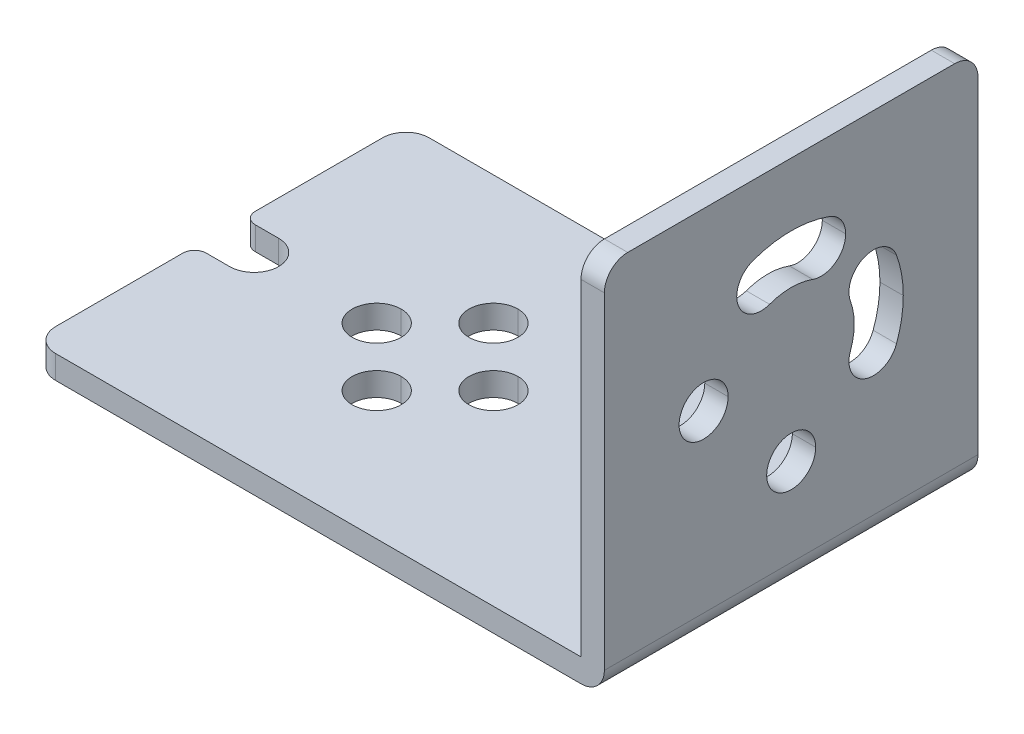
ISO-10303-21;
HEADER;
FILE_DESCRIPTION(('STEP AP214'),'2;1');
FILE_NAME('part.step','',(''),(''),'','','');
FILE_SCHEMA(('AUTOMOTIVE_DESIGN { 1 0 10303 214 1 1 1 1 }'));
ENDSEC;
DATA;
#1=APPLICATION_CONTEXT('core data for automotive mechanical design processes');
#2=APPLICATION_PROTOCOL_DEFINITION('international standard','automotive_design',2000,#1);
#3=PRODUCT_CONTEXT('',#1,'mechanical');
#4=PRODUCT('Part','Part','',(#3));
#5=PRODUCT_RELATED_PRODUCT_CATEGORY('part','',(#4));
#6=PRODUCT_DEFINITION_FORMATION('','',#4);
#7=PRODUCT_DEFINITION_CONTEXT('part definition',#1,'design');
#8=PRODUCT_DEFINITION('design','',#6,#7);
#9=PRODUCT_DEFINITION_SHAPE('','',#8);
#10=(LENGTH_UNIT() NAMED_UNIT(*) SI_UNIT(.MILLI.,.METRE.));
#11=(NAMED_UNIT(*) PLANE_ANGLE_UNIT() SI_UNIT($,.RADIAN.));
#12=(NAMED_UNIT(*) SI_UNIT($,.STERADIAN.) SOLID_ANGLE_UNIT());
#13=UNCERTAINTY_MEASURE_WITH_UNIT(LENGTH_MEASURE(1.E-05),#10,'distance_accuracy_value','');
#14=(GEOMETRIC_REPRESENTATION_CONTEXT(3) GLOBAL_UNCERTAINTY_ASSIGNED_CONTEXT((#13)) GLOBAL_UNIT_ASSIGNED_CONTEXT((#10,
#11,#12)) REPRESENTATION_CONTEXT('',''));
#15=CARTESIAN_POINT('',(0.,0.,0.));
#16=DIRECTION('',(0.,0.,1.));
#17=DIRECTION('',(1.,0.,0.));
#18=AXIS2_PLACEMENT_3D('',#15,#16,#17);
#19=CARTESIAN_POINT('',(-2.,2.,-16.));
#20=DIRECTION('',(0.,0.,-1.));
#21=DIRECTION('',(-1.,0.,0.));
#22=AXIS2_PLACEMENT_3D('',#19,#20,#21);
#23=CYLINDRICAL_SURFACE('',#22,2.);
#24=CARTESIAN_POINT('',(-2.,2.,16.));
#25=DIRECTION('',(0.,0.,1.));
#26=DIRECTION('',(-1.,0.,0.));
#27=AXIS2_PLACEMENT_3D('',#24,#25,#26);
#28=CIRCLE('',#27,2.);
#29=CARTESIAN_POINT('',(-2.,0.,16.));
#30=VERTEX_POINT('',#29);
#31=CARTESIAN_POINT('',(0.,2.,16.));
#32=VERTEX_POINT('',#31);
#33=EDGE_CURVE('E394',#30,#32,#28,.T.);
#34=ORIENTED_EDGE('',*,*,#33,.F.);
#35=DIRECTION('',(0.,0.,1.));
#36=VECTOR('',#35,1.);
#37=CARTESIAN_POINT('',(-2.,0.,14.));
#38=LINE('',#37,#36);
#39=CARTESIAN_POINT('',(-2.,0.,-16.));
#40=VERTEX_POINT('',#39);
#41=EDGE_CURVE('E683',#40,#30,#38,.T.);
#42=ORIENTED_EDGE('',*,*,#41,.F.);
#43=CARTESIAN_POINT('',(-2.,2.,-16.));
#44=DIRECTION('',(0.,0.,-1.));
#45=DIRECTION('',(1.,0.,0.));
#46=AXIS2_PLACEMENT_3D('',#43,#44,#45);
#47=CIRCLE('',#46,2.);
#48=CARTESIAN_POINT('',(0.,2.,-16.));
#49=VERTEX_POINT('',#48);
#50=EDGE_CURVE('E560',#49,#40,#47,.T.);
#51=ORIENTED_EDGE('',*,*,#50,.F.);
#52=DIRECTION('',(0.,0.,-1.));
#53=VECTOR('',#52,1.);
#54=CARTESIAN_POINT('',(0.,2.,-16.));
#55=LINE('',#54,#53);
#56=EDGE_CURVE('E316',#32,#49,#55,.T.);
#57=ORIENTED_EDGE('',*,*,#56,.F.);
#58=EDGE_LOOP('',(#34,#42,#51,#57));
#59=FACE_BOUND('',#58,.T.);
#60=ADVANCED_FACE('F16',(#59),#23,.T.);
#61=CARTESIAN_POINT('',(-2.,24.0476946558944,-2.56515107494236));
#62=DIRECTION('',(1.,0.,0.));
#63=DIRECTION('',(0.,0.,-1.));
#64=AXIS2_PLACEMENT_3D('',#61,#62,#63);
#65=CYLINDRICAL_SURFACE('',#64,2.1);
#66=DIRECTION('',(1.,0.,0.));
#67=VECTOR('',#66,1.);
#68=CARTESIAN_POINT('',(-2.,24.0476946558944,-4.66515107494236));
#69=LINE('',#68,#67);
#70=CARTESIAN_POINT('',(-2.,24.0476946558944,-4.66515107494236));
#71=VERTEX_POINT('',#70);
#72=CARTESIAN_POINT('',(0.,24.0476946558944,-4.66515107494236));
#73=VERTEX_POINT('',#72);
#74=EDGE_CURVE('E287',#71,#73,#69,.T.);
#75=ORIENTED_EDGE('',*,*,#74,.F.);
#76=CARTESIAN_POINT('',(-2.,24.0476946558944,-2.56515107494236));
#77=DIRECTION('',(1.,0.,0.));
#78=DIRECTION('',(0.,0.,-1.));
#79=AXIS2_PLACEMENT_3D('',#76,#77,#78);
#80=CIRCLE('',#79,2.1);
#81=CARTESIAN_POINT('',(-2.,22.0743401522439,-1.84690877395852));
#82=VERTEX_POINT('',#81);
#83=EDGE_CURVE('E283',#82,#71,#80,.T.);
#84=ORIENTED_EDGE('',*,*,#83,.F.);
#85=DIRECTION('',(1.,0.,0.));
#86=VECTOR('',#85,1.);
#87=CARTESIAN_POINT('',(-2.,22.0743401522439,-1.84690877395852));
#88=LINE('',#87,#86);
#89=CARTESIAN_POINT('',(0.,22.0743401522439,-1.84690877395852));
#90=VERTEX_POINT('',#89);
#91=EDGE_CURVE('E268',#82,#90,#88,.T.);
#92=ORIENTED_EDGE('',*,*,#91,.T.);
#93=CARTESIAN_POINT('',(0.,24.0476946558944,-2.56515107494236));
#94=DIRECTION('',(1.,0.,0.));
#95=DIRECTION('',(0.,0.,-1.));
#96=AXIS2_PLACEMENT_3D('',#93,#94,#95);
#97=CIRCLE('',#96,2.1);
#98=EDGE_CURVE('E338',#90,#73,#97,.T.);
#99=ORIENTED_EDGE('',*,*,#98,.T.);
#100=EDGE_LOOP('',(#75,#84,#92,#99));
#101=FACE_BOUND('',#100,.T.);
#102=ADVANCED_FACE('F284',(#101),#65,.F.);
#103=CARTESIAN_POINT('',(-2.,17.,0.));
#104=DIRECTION('',(1.,0.,0.));
#105=DIRECTION('',(0.,0.,-1.));
#106=AXIS2_PLACEMENT_3D('',#103,#104,#105);
#107=CYLINDRICAL_SURFACE('',#106,9.6);
#108=CARTESIAN_POINT('',(0.,17.,0.));
#109=DIRECTION('',(1.,0.,0.));
#110=DIRECTION('',(0.,0.,-1.));
#111=AXIS2_PLACEMENT_3D('',#108,#109,#110);
#112=CIRCLE('',#111,9.6);
#113=CARTESIAN_POINT('',(0.,26.0210491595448,-3.28339337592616));
#114=VERTEX_POINT('',#113);
#115=CARTESIAN_POINT('',(0.,26.0210491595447,3.28339337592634));
#116=VERTEX_POINT('',#115);
#117=EDGE_CURVE('E334',#114,#116,#112,.T.);
#118=ORIENTED_EDGE('',*,*,#117,.T.);
#119=DIRECTION('',(1.,0.,0.));
#120=VECTOR('',#119,1.);
#121=CARTESIAN_POINT('',(-2.,26.0210491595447,3.28339337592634));
#122=LINE('',#121,#120);
#123=CARTESIAN_POINT('',(-2.,26.0210491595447,3.28339337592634));
#124=VERTEX_POINT('',#123);
#125=EDGE_CURVE('E10',#124,#116,#122,.T.);
#126=ORIENTED_EDGE('',*,*,#125,.F.);
#127=CARTESIAN_POINT('',(-2.,17.,0.));
#128=DIRECTION('',(1.,0.,0.));
#129=DIRECTION('',(0.,0.,-1.));
#130=AXIS2_PLACEMENT_3D('',#127,#128,#129);
#131=CIRCLE('',#130,9.6);
#132=CARTESIAN_POINT('',(-2.,26.0210491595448,-3.28339337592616));
#133=VERTEX_POINT('',#132);
#134=EDGE_CURVE('E292',#133,#124,#131,.T.);
#135=ORIENTED_EDGE('',*,*,#134,.F.);
#136=DIRECTION('',(1.,0.,0.));
#137=VECTOR('',#136,1.);
#138=CARTESIAN_POINT('',(-2.,26.0210491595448,-3.28339337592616));
#139=LINE('',#138,#137);
#140=EDGE_CURVE('E453',#133,#114,#139,.T.);
#141=ORIENTED_EDGE('',*,*,#140,.T.);
#142=EDGE_LOOP('',(#118,#126,#135,#141));
#143=FACE_BOUND('',#142,.T.);
#144=ADVANCED_FACE('F847',(#143),#107,.F.);
#145=CARTESIAN_POINT('',(-2.,24.0476946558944,2.56515107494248));
#146=DIRECTION('',(1.,0.,0.));
#147=DIRECTION('',(0.,0.,-1.));
#148=AXIS2_PLACEMENT_3D('',#145,#146,#147);
#149=CYLINDRICAL_SURFACE('',#148,2.1);
#150=CARTESIAN_POINT('',(0.,24.0476946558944,2.56515107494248));
#151=DIRECTION('',(1.,0.,0.));
#152=DIRECTION('',(0.,0.,-1.));
#153=AXIS2_PLACEMENT_3D('',#150,#151,#152);
#154=CIRCLE('',#153,2.1);
#155=CARTESIAN_POINT('',(0.,22.0743401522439,1.84690877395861));
#156=VERTEX_POINT('',#155);
#157=EDGE_CURVE('E330',#116,#156,#154,.T.);
#158=ORIENTED_EDGE('',*,*,#157,.T.);
#159=DIRECTION('',(1.,0.,0.));
#160=VECTOR('',#159,1.);
#161=CARTESIAN_POINT('',(-2.,22.0743401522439,1.84690877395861));
#162=LINE('',#161,#160);
#163=CARTESIAN_POINT('',(-2.,22.0743401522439,1.84690877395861));
#164=VERTEX_POINT('',#163);
#165=EDGE_CURVE('E26',#164,#156,#162,.T.);
#166=ORIENTED_EDGE('',*,*,#165,.F.);
#167=CARTESIAN_POINT('',(-2.,24.0476946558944,2.56515107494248));
#168=DIRECTION('',(1.,0.,0.));
#169=DIRECTION('',(0.,0.,-1.));
#170=AXIS2_PLACEMENT_3D('',#167,#168,#169);
#171=CIRCLE('',#170,2.1);
#172=EDGE_CURVE('E298',#124,#164,#171,.T.);
#173=ORIENTED_EDGE('',*,*,#172,.F.);
#174=ORIENTED_EDGE('',*,*,#125,.T.);
#175=EDGE_LOOP('',(#158,#166,#173,#174));
#176=FACE_BOUND('',#175,.T.);
#177=ADVANCED_FACE('F934',(#176),#149,.F.);
#178=CARTESIAN_POINT('',(-2.,17.,0.));
#179=DIRECTION('',(1.,0.,0.));
#180=DIRECTION('',(0.,0.,-1.));
#181=AXIS2_PLACEMENT_3D('',#178,#179,#180);
#182=CYLINDRICAL_SURFACE('',#181,5.4);
#183=CARTESIAN_POINT('',(0.,17.,0.));
#184=DIRECTION('',(-1.,0.,0.));
#185=DIRECTION('',(0.,0.,-1.));
#186=AXIS2_PLACEMENT_3D('',#183,#184,#185);
#187=CIRCLE('',#186,5.4);
#188=EDGE_CURVE('E275',#156,#90,#187,.T.);
#189=ORIENTED_EDGE('',*,*,#188,.T.);
#190=ORIENTED_EDGE('',*,*,#91,.F.);
#191=CARTESIAN_POINT('',(-2.,17.,0.));
#192=DIRECTION('',(-1.,0.,0.));
#193=DIRECTION('',(0.,0.,-1.));
#194=AXIS2_PLACEMENT_3D('',#191,#192,#193);
#195=CIRCLE('',#194,5.4);
#196=EDGE_CURVE('E272',#164,#82,#195,.T.);
#197=ORIENTED_EDGE('',*,*,#196,.F.);
#198=ORIENTED_EDGE('',*,*,#165,.T.);
#199=EDGE_LOOP('',(#189,#190,#197,#198));
#200=FACE_BOUND('',#199,.T.);
#201=ADVANCED_FACE('F270',(#200),#182,.T.);
#202=CARTESIAN_POINT('',(-2.,9.5,-1.17961196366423E-13));
#203=DIRECTION('',(1.,0.,0.));
#204=DIRECTION('',(0.,0.,-1.));
#205=AXIS2_PLACEMENT_3D('',#202,#203,#204);
#206=CYLINDRICAL_SURFACE('',#205,2.1);
#207=DIRECTION('',(1.,0.,0.));
#208=VECTOR('',#207,1.);
#209=CARTESIAN_POINT('',(-2.,9.5,2.09999999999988));
#210=LINE('',#209,#208);
#211=CARTESIAN_POINT('',(-2.,9.5,2.09999999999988));
#212=VERTEX_POINT('',#211);
#213=CARTESIAN_POINT('',(0.,9.5,2.09999999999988));
#214=VERTEX_POINT('',#213);
#215=EDGE_CURVE('E469',#212,#214,#210,.T.);
#216=ORIENTED_EDGE('',*,*,#215,.F.);
#217=CARTESIAN_POINT('',(-2.,9.5,-1.17961196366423E-13));
#218=DIRECTION('',(1.,0.,0.));
#219=DIRECTION('',(0.,0.,-1.));
#220=AXIS2_PLACEMENT_3D('',#217,#218,#219);
#221=CIRCLE('',#220,2.1);
#222=CARTESIAN_POINT('',(-2.,9.5,-2.10000000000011));
#223=VERTEX_POINT('',#222);
#224=EDGE_CURVE('E390',#223,#212,#221,.T.);
#225=ORIENTED_EDGE('',*,*,#224,.F.);
#226=DIRECTION('',(1.,0.,0.));
#227=VECTOR('',#226,1.);
#228=CARTESIAN_POINT('',(-2.,9.5,-2.10000000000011));
#229=LINE('',#228,#227);
#230=CARTESIAN_POINT('',(0.,9.5,-2.10000000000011));
#231=VERTEX_POINT('',#230);
#232=EDGE_CURVE('E468',#223,#231,#229,.T.);
#233=ORIENTED_EDGE('',*,*,#232,.T.);
#234=CARTESIAN_POINT('',(0.,9.5,-1.17961196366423E-13));
#235=DIRECTION('',(1.,0.,0.));
#236=DIRECTION('',(0.,0.,-1.));
#237=AXIS2_PLACEMENT_3D('',#234,#235,#236);
#238=CIRCLE('',#237,2.1);
#239=EDGE_CURVE('E347',#231,#214,#238,.T.);
#240=ORIENTED_EDGE('',*,*,#239,.T.);
#241=EDGE_LOOP('',(#216,#225,#233,#240));
#242=FACE_BOUND('',#241,.T.);
#243=ADVANCED_FACE('F921',(#242),#206,.F.);
#244=CARTESIAN_POINT('',(-2.,14.4348489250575,-7.04769465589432));
#245=DIRECTION('',(1.,0.,0.));
#246=DIRECTION('',(0.,0.,-1.));
#247=AXIS2_PLACEMENT_3D('',#244,#245,#246);
#248=CYLINDRICAL_SURFACE('',#247,2.1);
#249=CARTESIAN_POINT('',(0.,14.4348489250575,-7.04769465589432));
#250=DIRECTION('',(1.,0.,0.));
#251=DIRECTION('',(0.,0.,-1.));
#252=AXIS2_PLACEMENT_3D('',#249,#250,#251);
#253=CIRCLE('',#252,2.1);
#254=CARTESIAN_POINT('',(0.,15.1530912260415,-5.07434015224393));
#255=VERTEX_POINT('',#254);
#256=CARTESIAN_POINT('',(0.,13.7166066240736,-9.02104915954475));
#257=VERTEX_POINT('',#256);
#258=EDGE_CURVE('E371',#255,#257,#253,.T.);
#259=ORIENTED_EDGE('',*,*,#258,.T.);
#260=DIRECTION('',(1.,0.,0.));
#261=VECTOR('',#260,1.);
#262=CARTESIAN_POINT('',(-2.,13.7166066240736,-9.02104915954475));
#263=LINE('',#262,#261);
#264=CARTESIAN_POINT('',(-2.,13.7166066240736,-9.02104915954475));
#265=VERTEX_POINT('',#264);
#266=EDGE_CURVE('E19',#265,#257,#263,.T.);
#267=ORIENTED_EDGE('',*,*,#266,.F.);
#268=CARTESIAN_POINT('',(-2.,14.4348489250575,-7.04769465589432));
#269=DIRECTION('',(1.,0.,0.));
#270=DIRECTION('',(0.,0.,-1.));
#271=AXIS2_PLACEMENT_3D('',#268,#269,#270);
#272=CIRCLE('',#271,2.1);
#273=CARTESIAN_POINT('',(-2.,15.1530912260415,-5.07434015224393));
#274=VERTEX_POINT('',#273);
#275=EDGE_CURVE('E343',#274,#265,#272,.T.);
#276=ORIENTED_EDGE('',*,*,#275,.F.);
#277=DIRECTION('',(1.,0.,0.));
#278=VECTOR('',#277,1.);
#279=CARTESIAN_POINT('',(-2.,15.1530912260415,-5.07434015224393));
#280=LINE('',#279,#278);
#281=EDGE_CURVE('E492',#274,#255,#280,.T.);
#282=ORIENTED_EDGE('',*,*,#281,.T.);
#283=EDGE_LOOP('',(#259,#267,#276,#282));
#284=FACE_BOUND('',#283,.T.);
#285=ADVANCED_FACE('F919',(#284),#248,.F.);
#286=CARTESIAN_POINT('',(-2.,17.,0.));
#287=DIRECTION('',(1.,0.,0.));
#288=DIRECTION('',(0.,0.,-1.));
#289=AXIS2_PLACEMENT_3D('',#286,#287,#288);
#290=CYLINDRICAL_SURFACE('',#289,9.6);
#291=DIRECTION('',(1.,0.,0.));
#292=VECTOR('',#291,1.);
#293=CARTESIAN_POINT('',(-2.,17.,-9.6));
#294=LINE('',#293,#292);
#295=CARTESIAN_POINT('',(-2.,17.,-9.6));
#296=VERTEX_POINT('',#295);
#297=CARTESIAN_POINT('',(0.,17.,-9.6));
#298=VERTEX_POINT('',#297);
#299=EDGE_CURVE('E480',#296,#298,#294,.T.);
#300=ORIENTED_EDGE('',*,*,#299,.F.);
#301=CARTESIAN_POINT('',(-2.,17.,0.));
#302=DIRECTION('',(1.,0.,0.));
#303=DIRECTION('',(0.,0.,-1.));
#304=AXIS2_PLACEMENT_3D('',#301,#302,#303);
#305=CIRCLE('',#304,9.6);
#306=EDGE_CURVE('E420',#265,#296,#305,.T.);
#307=ORIENTED_EDGE('',*,*,#306,.F.);
#308=ORIENTED_EDGE('',*,*,#266,.T.);
#309=CARTESIAN_POINT('',(0.,17.,0.));
#310=DIRECTION('',(1.,0.,0.));
#311=DIRECTION('',(0.,0.,-1.));
#312=AXIS2_PLACEMENT_3D('',#309,#310,#311);
#313=CIRCLE('',#312,9.6);
#314=EDGE_CURVE('E361',#257,#298,#313,.T.);
#315=ORIENTED_EDGE('',*,*,#314,.T.);
#316=EDGE_LOOP('',(#300,#307,#308,#315));
#317=FACE_BOUND('',#316,.T.);
#318=ADVANCED_FACE('F901',(#317),#290,.F.);
#319=CARTESIAN_POINT('',(-2.,19.5651510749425,-7.04769465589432));
#320=DIRECTION('',(1.,0.,0.));
#321=DIRECTION('',(0.,0.,-1.));
#322=AXIS2_PLACEMENT_3D('',#319,#320,#321);
#323=CYLINDRICAL_SURFACE('',#322,2.1);
#324=CARTESIAN_POINT('',(0.,19.5651510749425,-7.04769465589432));
#325=DIRECTION('',(1.,0.,0.));
#326=DIRECTION('',(0.,0.,-1.));
#327=AXIS2_PLACEMENT_3D('',#324,#325,#326);
#328=CIRCLE('',#327,2.1);
#329=CARTESIAN_POINT('',(0.,20.2833933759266,-9.02104915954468));
#330=VERTEX_POINT('',#329);
#331=CARTESIAN_POINT('',(0.,18.8469087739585,-5.07434015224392));
#332=VERTEX_POINT('',#331);
#333=EDGE_CURVE('E357',#330,#332,#328,.T.);
#334=ORIENTED_EDGE('',*,*,#333,.T.);
#335=DIRECTION('',(1.,0.,0.));
#336=VECTOR('',#335,1.);
#337=CARTESIAN_POINT('',(-2.,18.8469087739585,-5.07434015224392));
#338=LINE('',#337,#336);
#339=CARTESIAN_POINT('',(-2.,18.8469087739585,-5.07434015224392));
#340=VERTEX_POINT('',#339);
#341=EDGE_CURVE('E432',#340,#332,#338,.T.);
#342=ORIENTED_EDGE('',*,*,#341,.F.);
#343=CARTESIAN_POINT('',(-2.,19.5651510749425,-7.04769465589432));
#344=DIRECTION('',(1.,0.,0.));
#345=DIRECTION('',(0.,0.,-1.));
#346=AXIS2_PLACEMENT_3D('',#343,#344,#345);
#347=CIRCLE('',#346,2.1);
#348=CARTESIAN_POINT('',(-2.,20.2833933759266,-9.02104915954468));
#349=VERTEX_POINT('',#348);
#350=EDGE_CURVE('E344',#349,#340,#347,.T.);
#351=ORIENTED_EDGE('',*,*,#350,.F.);
#352=DIRECTION('',(1.,0.,0.));
#353=VECTOR('',#352,1.);
#354=CARTESIAN_POINT('',(-2.,20.2833933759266,-9.02104915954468));
#355=LINE('',#354,#353);
#356=EDGE_CURVE('E485',#349,#330,#355,.T.);
#357=ORIENTED_EDGE('',*,*,#356,.T.);
#358=EDGE_LOOP('',(#334,#342,#351,#357));
#359=FACE_BOUND('',#358,.T.);
#360=ADVANCED_FACE('F908',(#359),#323,.F.);
#361=CARTESIAN_POINT('',(-2.,17.,0.));
#362=DIRECTION('',(1.,0.,0.));
#363=DIRECTION('',(0.,0.,-1.));
#364=AXIS2_PLACEMENT_3D('',#361,#362,#363);
#365=CYLINDRICAL_SURFACE('',#364,5.4);
#366=DIRECTION('',(1.,0.,0.));
#367=VECTOR('',#366,1.);
#368=CARTESIAN_POINT('',(-2.,17.,-5.4));
#369=LINE('',#368,#367);
#370=CARTESIAN_POINT('',(-2.,17.,-5.4));
#371=VERTEX_POINT('',#370);
#372=CARTESIAN_POINT('',(0.,17.,-5.4));
#373=VERTEX_POINT('',#372);
#374=EDGE_CURVE('E493',#371,#373,#369,.T.);
#375=ORIENTED_EDGE('',*,*,#374,.F.);
#376=CARTESIAN_POINT('',(-2.,17.,0.));
#377=DIRECTION('',(-1.,0.,0.));
#378=DIRECTION('',(0.,0.,-1.));
#379=AXIS2_PLACEMENT_3D('',#376,#377,#378);
#380=CIRCLE('',#379,5.4);
#381=EDGE_CURVE('E339',#340,#371,#380,.T.);
#382=ORIENTED_EDGE('',*,*,#381,.F.);
#383=ORIENTED_EDGE('',*,*,#341,.T.);
#384=CARTESIAN_POINT('',(0.,17.,0.));
#385=DIRECTION('',(-1.,0.,0.));
#386=DIRECTION('',(0.,0.,-1.));
#387=AXIS2_PLACEMENT_3D('',#384,#385,#386);
#388=CIRCLE('',#387,5.4);
#389=EDGE_CURVE('E351',#332,#373,#388,.T.);
#390=ORIENTED_EDGE('',*,*,#389,.T.);
#391=EDGE_LOOP('',(#375,#382,#383,#390));
#392=FACE_BOUND('',#391,.T.);
#393=ADVANCED_FACE('F915',(#392),#365,.T.);
#394=CARTESIAN_POINT('',(-2.,17.,7.5));
#395=DIRECTION('',(1.,0.,0.));
#396=DIRECTION('',(0.,0.,-1.));
#397=AXIS2_PLACEMENT_3D('',#394,#395,#396);
#398=CYLINDRICAL_SURFACE('',#397,2.1);
#399=DIRECTION('',(1.,0.,0.));
#400=VECTOR('',#399,1.);
#401=CARTESIAN_POINT('',(-2.,17.,9.6));
#402=LINE('',#401,#400);
#403=CARTESIAN_POINT('',(-2.,17.,9.6));
#404=VERTEX_POINT('',#403);
#405=CARTESIAN_POINT('',(0.,17.,9.6));
#406=VERTEX_POINT('',#405);
#407=EDGE_CURVE('E528',#404,#406,#402,.T.);
#408=ORIENTED_EDGE('',*,*,#407,.F.);
#409=CARTESIAN_POINT('',(-2.,17.,7.5));
#410=DIRECTION('',(1.,0.,0.));
#411=DIRECTION('',(0.,0.,-1.));
#412=AXIS2_PLACEMENT_3D('',#409,#410,#411);
#413=CIRCLE('',#412,2.1);
#414=CARTESIAN_POINT('',(-2.,17.,5.4));
#415=VERTEX_POINT('',#414);
#416=EDGE_CURVE('E423',#415,#404,#413,.T.);
#417=ORIENTED_EDGE('',*,*,#416,.F.);
#418=DIRECTION('',(1.,0.,0.));
#419=VECTOR('',#418,1.);
#420=CARTESIAN_POINT('',(-2.,17.,5.4));
#421=LINE('',#420,#419);
#422=CARTESIAN_POINT('',(0.,17.,5.4));
#423=VERTEX_POINT('',#422);
#424=EDGE_CURVE('E536',#415,#423,#421,.T.);
#425=ORIENTED_EDGE('',*,*,#424,.T.);
#426=CARTESIAN_POINT('',(0.,17.,7.5));
#427=DIRECTION('',(1.,0.,0.));
#428=DIRECTION('',(0.,0.,-1.));
#429=AXIS2_PLACEMENT_3D('',#426,#427,#428);
#430=CIRCLE('',#429,2.1);
#431=EDGE_CURVE('E509',#423,#406,#430,.T.);
#432=ORIENTED_EDGE('',*,*,#431,.T.);
#433=EDGE_LOOP('',(#408,#417,#425,#432));
#434=FACE_BOUND('',#433,.T.);
#435=ADVANCED_FACE('F1328',(#434),#398,.F.);
#436=CARTESIAN_POINT('',(-2.,30.,14.));
#437=DIRECTION('',(1.,0.,0.));
#438=DIRECTION('',(0.,1.,0.));
#439=AXIS2_PLACEMENT_3D('',#436,#437,#438);
#440=PLANE('',#439);
#441=ORIENTED_EDGE('',*,*,#416,.T.);
#442=CARTESIAN_POINT('',(-2.,17.,7.5));
#443=DIRECTION('',(1.,0.,0.));
#444=DIRECTION('',(0.,0.,-1.));
#445=AXIS2_PLACEMENT_3D('',#442,#443,#444);
#446=CIRCLE('',#445,2.1);
#447=EDGE_CURVE('E519',#404,#415,#446,.T.);
#448=ORIENTED_EDGE('',*,*,#447,.T.);
#449=EDGE_LOOP('',(#441,#448));
#450=FACE_BOUND('',#449,.T.);
#451=ORIENTED_EDGE('',*,*,#350,.T.);
#452=ORIENTED_EDGE('',*,*,#381,.T.);
#453=CARTESIAN_POINT('',(-2.,17.,0.));
#454=DIRECTION('',(-1.,0.,0.));
#455=DIRECTION('',(0.,0.,-1.));
#456=AXIS2_PLACEMENT_3D('',#453,#454,#455);
#457=CIRCLE('',#456,5.4);
#458=EDGE_CURVE('E497',#371,#274,#457,.T.);
#459=ORIENTED_EDGE('',*,*,#458,.T.);
#460=ORIENTED_EDGE('',*,*,#275,.T.);
#461=ORIENTED_EDGE('',*,*,#306,.T.);
#462=CARTESIAN_POINT('',(-2.,17.,0.));
#463=DIRECTION('',(1.,0.,0.));
#464=DIRECTION('',(0.,0.,-1.));
#465=AXIS2_PLACEMENT_3D('',#462,#463,#464);
#466=CIRCLE('',#465,9.6);
#467=EDGE_CURVE('E477',#296,#349,#466,.T.);
#468=ORIENTED_EDGE('',*,*,#467,.T.);
#469=EDGE_LOOP('',(#451,#452,#459,#460,#461,#468));
#470=FACE_BOUND('',#469,.T.);
#471=ORIENTED_EDGE('',*,*,#224,.T.);
#472=CARTESIAN_POINT('',(-2.,9.5,-1.17961196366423E-13));
#473=DIRECTION('',(1.,0.,0.));
#474=DIRECTION('',(0.,0.,-1.));
#475=AXIS2_PLACEMENT_3D('',#472,#473,#474);
#476=CIRCLE('',#475,2.1);
#477=EDGE_CURVE('E457',#212,#223,#476,.T.);
#478=ORIENTED_EDGE('',*,*,#477,.T.);
#479=EDGE_LOOP('',(#471,#478));
#480=FACE_BOUND('',#479,.T.);
#481=ORIENTED_EDGE('',*,*,#172,.T.);
#482=ORIENTED_EDGE('',*,*,#196,.T.);
#483=ORIENTED_EDGE('',*,*,#83,.T.);
#484=CARTESIAN_POINT('',(-2.,24.0476946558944,-2.56515107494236));
#485=DIRECTION('',(1.,0.,0.));
#486=DIRECTION('',(0.,0.,-1.));
#487=AXIS2_PLACEMENT_3D('',#484,#485,#486);
#488=CIRCLE('',#487,2.1);
#489=EDGE_CURVE('E871',#71,#133,#488,.T.);
#490=ORIENTED_EDGE('',*,*,#489,.T.);
#491=ORIENTED_EDGE('',*,*,#134,.T.);
#492=EDGE_LOOP('',(#481,#482,#483,#490,#491));
#493=FACE_BOUND('',#492,.T.);
#494=DIRECTION('',(0.,0.,-1.));
#495=VECTOR('',#494,1.);
#496=CARTESIAN_POINT('',(-2.,2.,14.));
#497=LINE('',#496,#495);
#498=CARTESIAN_POINT('',(-2.,2.,16.));
#499=VERTEX_POINT('',#498);
#500=CARTESIAN_POINT('',(-2.,2.,-16.));
#501=VERTEX_POINT('',#500);
#502=EDGE_CURVE('E642',#499,#501,#497,.T.);
#503=ORIENTED_EDGE('',*,*,#502,.F.);
#504=DIRECTION('',(0.,-1.,0.));
#505=VECTOR('',#504,1.);
#506=CARTESIAN_POINT('',(-2.,30.,16.));
#507=LINE('',#506,#505);
#508=CARTESIAN_POINT('',(-2.,30.,16.));
#509=VERTEX_POINT('',#508);
#510=EDGE_CURVE('E400',#509,#499,#507,.T.);
#511=ORIENTED_EDGE('',*,*,#510,.F.);
#512=CARTESIAN_POINT('',(-2.,30.,14.));
#513=DIRECTION('',(1.,0.,0.));
#514=DIRECTION('',(0.,0.,-1.));
#515=AXIS2_PLACEMENT_3D('',#512,#513,#514);
#516=CIRCLE('',#515,2.);
#517=CARTESIAN_POINT('',(-2.,32.,14.));
#518=VERTEX_POINT('',#517);
#519=EDGE_CURVE('E406',#518,#509,#516,.T.);
#520=ORIENTED_EDGE('',*,*,#519,.F.);
#521=DIRECTION('',(0.,0.,1.));
#522=VECTOR('',#521,1.);
#523=CARTESIAN_POINT('',(-2.,32.,14.));
#524=LINE('',#523,#522);
#525=CARTESIAN_POINT('',(-2.,32.,-14.));
#526=VERTEX_POINT('',#525);
#527=EDGE_CURVE('E413',#526,#518,#524,.T.);
#528=ORIENTED_EDGE('',*,*,#527,.F.);
#529=CARTESIAN_POINT('',(-2.,30.,-14.));
#530=DIRECTION('',(1.,0.,0.));
#531=DIRECTION('',(0.,0.,-1.));
#532=AXIS2_PLACEMENT_3D('',#529,#530,#531);
#533=CIRCLE('',#532,2.);
#534=CARTESIAN_POINT('',(-2.,30.,-16.));
#535=VERTEX_POINT('',#534);
#536=EDGE_CURVE('E305',#535,#526,#533,.T.);
#537=ORIENTED_EDGE('',*,*,#536,.F.);
#538=DIRECTION('',(0.,1.,0.));
#539=VECTOR('',#538,1.);
#540=CARTESIAN_POINT('',(-2.,2.,-16.));
#541=LINE('',#540,#539);
#542=EDGE_CURVE('E362',#501,#535,#541,.T.);
#543=ORIENTED_EDGE('',*,*,#542,.F.);
#544=EDGE_LOOP('',(#503,#511,#520,#528,#537,#543));
#545=FACE_BOUND('',#544,.T.);
#546=ADVANCED_FACE('F294',(#450,#470,#480,#493,#545),#440,.F.);
#547=CARTESIAN_POINT('',(-2.,30.,-14.));
#548=DIRECTION('',(1.,0.,0.));
#549=DIRECTION('',(0.,0.,-1.));
#550=AXIS2_PLACEMENT_3D('',#547,#548,#549);
#551=CYLINDRICAL_SURFACE('',#550,2.);
#552=CARTESIAN_POINT('',(0.,30.,-14.));
#553=DIRECTION('',(1.,0.,0.));
#554=DIRECTION('',(0.,0.,-1.));
#555=AXIS2_PLACEMENT_3D('',#552,#553,#554);
#556=CIRCLE('',#555,2.);
#557=CARTESIAN_POINT('',(0.,30.,-16.));
#558=VERTEX_POINT('',#557);
#559=CARTESIAN_POINT('',(0.,32.,-14.));
#560=VERTEX_POINT('',#559);
#561=EDGE_CURVE('E315',#558,#560,#556,.T.);
#562=ORIENTED_EDGE('',*,*,#561,.F.);
#563=DIRECTION('',(1.,0.,0.));
#564=VECTOR('',#563,1.);
#565=CARTESIAN_POINT('',(-2.,30.,-16.));
#566=LINE('',#565,#564);
#567=EDGE_CURVE('E366',#535,#558,#566,.T.);
#568=ORIENTED_EDGE('',*,*,#567,.F.);
#569=ORIENTED_EDGE('',*,*,#536,.T.);
#570=DIRECTION('',(1.,0.,0.));
#571=VECTOR('',#570,1.);
#572=CARTESIAN_POINT('',(-2.,32.,-14.));
#573=LINE('',#572,#571);
#574=EDGE_CURVE('E409',#526,#560,#573,.T.);
#575=ORIENTED_EDGE('',*,*,#574,.T.);
#576=EDGE_LOOP('',(#562,#568,#569,#575));
#577=FACE_BOUND('',#576,.T.);
#578=ADVANCED_FACE('F1327',(#577),#551,.T.);
#579=CARTESIAN_POINT('',(-2.,32.,14.));
#580=DIRECTION('',(0.,1.,0.));
#581=DIRECTION('',(0.,0.,-1.));
#582=AXIS2_PLACEMENT_3D('',#579,#580,#581);
#583=PLANE('',#582);
#584=DIRECTION('',(0.,0.,1.));
#585=VECTOR('',#584,1.);
#586=CARTESIAN_POINT('',(0.,32.,14.));
#587=LINE('',#586,#585);
#588=CARTESIAN_POINT('',(0.,32.,14.));
#589=VERTEX_POINT('',#588);
#590=EDGE_CURVE('E320',#560,#589,#587,.T.);
#591=ORIENTED_EDGE('',*,*,#590,.F.);
#592=ORIENTED_EDGE('',*,*,#574,.F.);
#593=ORIENTED_EDGE('',*,*,#527,.T.);
#594=DIRECTION('',(1.,0.,0.));
#595=VECTOR('',#594,1.);
#596=CARTESIAN_POINT('',(-2.,32.,14.));
#597=LINE('',#596,#595);
#598=EDGE_CURVE('E403',#518,#589,#597,.T.);
#599=ORIENTED_EDGE('',*,*,#598,.T.);
#600=EDGE_LOOP('',(#591,#592,#593,#599));
#601=FACE_BOUND('',#600,.T.);
#602=ADVANCED_FACE('F1334',(#601),#583,.T.);
#603=CARTESIAN_POINT('',(-2.,30.,14.));
#604=DIRECTION('',(1.,0.,0.));
#605=DIRECTION('',(0.,0.,-1.));
#606=AXIS2_PLACEMENT_3D('',#603,#604,#605);
#607=CYLINDRICAL_SURFACE('',#606,2.);
#608=CARTESIAN_POINT('',(0.,30.,14.));
#609=DIRECTION('',(1.,0.,0.));
#610=DIRECTION('',(0.,0.,-1.));
#611=AXIS2_PLACEMENT_3D('',#608,#609,#610);
#612=CIRCLE('',#611,2.);
#613=CARTESIAN_POINT('',(0.,30.,16.));
#614=VERTEX_POINT('',#613);
#615=EDGE_CURVE('E324',#589,#614,#612,.T.);
#616=ORIENTED_EDGE('',*,*,#615,.F.);
#617=ORIENTED_EDGE('',*,*,#598,.F.);
#618=ORIENTED_EDGE('',*,*,#519,.T.);
#619=DIRECTION('',(1.,0.,0.));
#620=VECTOR('',#619,1.);
#621=CARTESIAN_POINT('',(-2.,30.,16.));
#622=LINE('',#621,#620);
#623=EDGE_CURVE('E397',#509,#614,#622,.T.);
#624=ORIENTED_EDGE('',*,*,#623,.T.);
#625=EDGE_LOOP('',(#616,#617,#618,#624));
#626=FACE_BOUND('',#625,.T.);
#627=ADVANCED_FACE('F1383',(#626),#607,.T.);
#628=CARTESIAN_POINT('',(-30.5,2.,5.));
#629=DIRECTION('',(0.,-1.,0.));
#630=DIRECTION('',(0.,0.,-1.));
#631=AXIS2_PLACEMENT_3D('',#628,#629,#630);
#632=CYLINDRICAL_SURFACE('',#631,2.1);
#633=DIRECTION('',(0.,-1.,0.));
#634=VECTOR('',#633,1.);
#635=CARTESIAN_POINT('',(-30.5,2.,7.1));
#636=LINE('',#635,#634);
#637=CARTESIAN_POINT('',(-30.5,2.,7.1));
#638=VERTEX_POINT('',#637);
#639=CARTESIAN_POINT('',(-30.5,0.,7.1));
#640=VERTEX_POINT('',#639);
#641=EDGE_CURVE('E544',#638,#640,#636,.T.);
#642=ORIENTED_EDGE('',*,*,#641,.F.);
#643=CARTESIAN_POINT('',(-30.5,2.,5.));
#644=DIRECTION('',(0.,1.,0.));
#645=DIRECTION('',(0.,0.,1.));
#646=AXIS2_PLACEMENT_3D('',#643,#644,#645);
#647=CIRCLE('',#646,2.1);
#648=CARTESIAN_POINT('',(-30.5,2.,2.9));
#649=VERTEX_POINT('',#648);
#650=EDGE_CURVE('E676',#638,#649,#647,.T.);
#651=ORIENTED_EDGE('',*,*,#650,.T.);
#652=DIRECTION('',(0.,-1.,0.));
#653=VECTOR('',#652,1.);
#654=CARTESIAN_POINT('',(-30.5,2.,2.9));
#655=LINE('',#654,#653);
#656=CARTESIAN_POINT('',(-30.5,0.,2.9));
#657=VERTEX_POINT('',#656);
#658=EDGE_CURVE('E552',#649,#657,#655,.T.);
#659=ORIENTED_EDGE('',*,*,#658,.T.);
#660=CARTESIAN_POINT('',(-30.5,0.,5.));
#661=DIRECTION('',(0.,1.,0.));
#662=DIRECTION('',(0.,0.,1.));
#663=AXIS2_PLACEMENT_3D('',#660,#661,#662);
#664=CIRCLE('',#663,2.1);
#665=EDGE_CURVE('E595',#640,#657,#664,.T.);
#666=ORIENTED_EDGE('',*,*,#665,.F.);
#667=EDGE_LOOP('',(#642,#651,#659,#666));
#668=FACE_BOUND('',#667,.T.);
#669=ADVANCED_FACE('F810',(#668),#632,.F.);
#670=CARTESIAN_POINT('',(-25.5,2.,0.));
#671=DIRECTION('',(0.,-1.,0.));
#672=DIRECTION('',(0.,0.,-1.));
#673=AXIS2_PLACEMENT_3D('',#670,#671,#672);
#674=CYLINDRICAL_SURFACE('',#673,2.1);
#675=DIRECTION('',(0.,-1.,0.));
#676=VECTOR('',#675,1.);
#677=CARTESIAN_POINT('',(-25.5,2.,2.1));
#678=LINE('',#677,#676);
#679=CARTESIAN_POINT('',(-25.5,2.,2.1));
#680=VERTEX_POINT('',#679);
#681=CARTESIAN_POINT('',(-25.5,0.,2.1));
#682=VERTEX_POINT('',#681);
#683=EDGE_CURVE('E564',#680,#682,#678,.T.);
#684=ORIENTED_EDGE('',*,*,#683,.F.);
#685=CARTESIAN_POINT('',(-25.5,2.,0.));
#686=DIRECTION('',(0.,1.,0.));
#687=DIRECTION('',(0.,0.,1.));
#688=AXIS2_PLACEMENT_3D('',#685,#686,#687);
#689=CIRCLE('',#688,2.1);
#690=CARTESIAN_POINT('',(-25.5,2.,-2.1));
#691=VERTEX_POINT('',#690);
#692=EDGE_CURVE('E570',#680,#691,#689,.T.);
#693=ORIENTED_EDGE('',*,*,#692,.T.);
#694=DIRECTION('',(0.,-1.,0.));
#695=VECTOR('',#694,1.);
#696=CARTESIAN_POINT('',(-25.5,2.,-2.1));
#697=LINE('',#696,#695);
#698=CARTESIAN_POINT('',(-25.5,0.,-2.1));
#699=VERTEX_POINT('',#698);
#700=EDGE_CURVE('E569',#691,#699,#697,.T.);
#701=ORIENTED_EDGE('',*,*,#700,.T.);
#702=CARTESIAN_POINT('',(-25.5,0.,0.));
#703=DIRECTION('',(0.,1.,0.));
#704=DIRECTION('',(0.,0.,1.));
#705=AXIS2_PLACEMENT_3D('',#702,#703,#704);
#706=CIRCLE('',#705,2.1);
#707=EDGE_CURVE('E591',#682,#699,#706,.T.);
#708=ORIENTED_EDGE('',*,*,#707,.F.);
#709=EDGE_LOOP('',(#684,#693,#701,#708));
#710=FACE_BOUND('',#709,.T.);
#711=ADVANCED_FACE('F972',(#710),#674,.F.);
#712=CARTESIAN_POINT('',(-30.5,2.,-5.));
#713=DIRECTION('',(0.,-1.,0.));
#714=DIRECTION('',(0.,0.,-1.));
#715=AXIS2_PLACEMENT_3D('',#712,#713,#714);
#716=CYLINDRICAL_SURFACE('',#715,2.1);
#717=DIRECTION('',(0.,-1.,0.));
#718=VECTOR('',#717,1.);
#719=CARTESIAN_POINT('',(-30.5,2.,-2.9));
#720=LINE('',#719,#718);
#721=CARTESIAN_POINT('',(-30.5,2.,-2.9));
#722=VERTEX_POINT('',#721);
#723=CARTESIAN_POINT('',(-30.5,0.,-2.9));
#724=VERTEX_POINT('',#723);
#725=EDGE_CURVE('E510',#722,#724,#720,.T.);
#726=ORIENTED_EDGE('',*,*,#725,.F.);
#727=CARTESIAN_POINT('',(-30.5,2.,-5.));
#728=DIRECTION('',(0.,1.,0.));
#729=DIRECTION('',(0.,0.,1.));
#730=AXIS2_PLACEMENT_3D('',#727,#728,#729);
#731=CIRCLE('',#730,2.1);
#732=CARTESIAN_POINT('',(-30.5,2.,-7.1));
#733=VERTEX_POINT('',#732);
#734=EDGE_CURVE('E673',#722,#733,#731,.T.);
#735=ORIENTED_EDGE('',*,*,#734,.T.);
#736=DIRECTION('',(0.,-1.,0.));
#737=VECTOR('',#736,1.);
#738=CARTESIAN_POINT('',(-30.5,2.,-7.1));
#739=LINE('',#738,#737);
#740=CARTESIAN_POINT('',(-30.5,0.,-7.1));
#741=VERTEX_POINT('',#740);
#742=EDGE_CURVE('E590',#733,#741,#739,.T.);
#743=ORIENTED_EDGE('',*,*,#742,.T.);
#744=CARTESIAN_POINT('',(-30.5,0.,-5.));
#745=DIRECTION('',(0.,1.,0.));
#746=DIRECTION('',(0.,0.,1.));
#747=AXIS2_PLACEMENT_3D('',#744,#745,#746);
#748=CIRCLE('',#747,2.1);
#749=EDGE_CURVE('E594',#724,#741,#748,.T.);
#750=ORIENTED_EDGE('',*,*,#749,.F.);
#751=EDGE_LOOP('',(#726,#735,#743,#750));
#752=FACE_BOUND('',#751,.T.);
#753=ADVANCED_FACE('F1412',(#752),#716,.F.);
#754=CARTESIAN_POINT('',(-35.5,2.,0.));
#755=DIRECTION('',(0.,-1.,0.));
#756=DIRECTION('',(0.,0.,-1.));
#757=AXIS2_PLACEMENT_3D('',#754,#755,#756);
#758=CYLINDRICAL_SURFACE('',#757,2.1);
#759=DIRECTION('',(0.,-1.,0.));
#760=VECTOR('',#759,1.);
#761=CARTESIAN_POINT('',(-35.5,2.,2.1));
#762=LINE('',#761,#760);
#763=CARTESIAN_POINT('',(-35.5,2.,2.1));
#764=VERTEX_POINT('',#763);
#765=CARTESIAN_POINT('',(-35.5,0.,2.1));
#766=VERTEX_POINT('',#765);
#767=EDGE_CURVE('E607',#764,#766,#762,.T.);
#768=ORIENTED_EDGE('',*,*,#767,.F.);
#769=CARTESIAN_POINT('',(-35.5,2.,0.));
#770=DIRECTION('',(0.,1.,0.));
#771=DIRECTION('',(0.,0.,1.));
#772=AXIS2_PLACEMENT_3D('',#769,#770,#771);
#773=CIRCLE('',#772,2.1);
#774=CARTESIAN_POINT('',(-35.5,2.,-2.1));
#775=VERTEX_POINT('',#774);
#776=EDGE_CURVE('E573',#764,#775,#773,.T.);
#777=ORIENTED_EDGE('',*,*,#776,.T.);
#778=DIRECTION('',(0.,-1.,0.));
#779=VECTOR('',#778,1.);
#780=CARTESIAN_POINT('',(-35.5,2.,-2.1));
#781=LINE('',#780,#779);
#782=CARTESIAN_POINT('',(-35.5,0.,-2.1));
#783=VERTEX_POINT('',#782);
#784=EDGE_CURVE('E615',#775,#783,#781,.T.);
#785=ORIENTED_EDGE('',*,*,#784,.T.);
#786=CARTESIAN_POINT('',(-35.5,0.,0.));
#787=DIRECTION('',(0.,1.,0.));
#788=DIRECTION('',(0.,0.,1.));
#789=AXIS2_PLACEMENT_3D('',#786,#787,#788);
#790=CIRCLE('',#789,2.1);
#791=EDGE_CURVE('E603',#766,#783,#790,.T.);
#792=ORIENTED_EDGE('',*,*,#791,.F.);
#793=EDGE_LOOP('',(#768,#777,#785,#792));
#794=FACE_BOUND('',#793,.T.);
#795=ADVANCED_FACE('F732',(#794),#758,.F.);
#796=CARTESIAN_POINT('',(-6.,2.,0.));
#797=DIRECTION('',(0.,-1.,0.));
#798=DIRECTION('',(0.,0.,-1.));
#799=AXIS2_PLACEMENT_3D('',#796,#797,#798);
#800=CYLINDRICAL_SURFACE('',#799,2.1);
#801=DIRECTION('',(0.,-1.,0.));
#802=VECTOR('',#801,1.);
#803=CARTESIAN_POINT('',(-6.,2.,2.1));
#804=LINE('',#803,#802);
#805=CARTESIAN_POINT('',(-6.,2.,2.1));
#806=VERTEX_POINT('',#805);
#807=CARTESIAN_POINT('',(-6.,0.,2.1));
#808=VERTEX_POINT('',#807);
#809=EDGE_CURVE('E627',#806,#808,#804,.T.);
#810=ORIENTED_EDGE('',*,*,#809,.F.);
#811=CARTESIAN_POINT('',(-6.,2.,0.));
#812=DIRECTION('',(0.,1.,0.));
#813=DIRECTION('',(0.,0.,1.));
#814=AXIS2_PLACEMENT_3D('',#811,#812,#813);
#815=CIRCLE('',#814,2.1);
#816=CARTESIAN_POINT('',(-6.,2.,-2.1));
#817=VERTEX_POINT('',#816);
#818=EDGE_CURVE('E670',#806,#817,#815,.T.);
#819=ORIENTED_EDGE('',*,*,#818,.T.);
#820=DIRECTION('',(0.,-1.,0.));
#821=VECTOR('',#820,1.);
#822=CARTESIAN_POINT('',(-6.,2.,-2.1));
#823=LINE('',#822,#821);
#824=CARTESIAN_POINT('',(-6.,0.,-2.1));
#825=VERTEX_POINT('',#824);
#826=EDGE_CURVE('E635',#817,#825,#823,.T.);
#827=ORIENTED_EDGE('',*,*,#826,.T.);
#828=CARTESIAN_POINT('',(-6.,0.,0.));
#829=DIRECTION('',(0.,1.,0.));
#830=DIRECTION('',(0.,0.,1.));
#831=AXIS2_PLACEMENT_3D('',#828,#829,#830);
#832=CIRCLE('',#831,2.1);
#833=EDGE_CURVE('E600',#808,#825,#832,.T.);
#834=ORIENTED_EDGE('',*,*,#833,.F.);
#835=EDGE_LOOP('',(#810,#819,#827,#834));
#836=FACE_BOUND('',#835,.T.);
#837=ADVANCED_FACE('F829',(#836),#800,.F.);
#838=CARTESIAN_POINT('',(-2.,2.,16.));
#839=DIRECTION('',(0.,0.,-1.));
#840=DIRECTION('',(0.,-1.,0.));
#841=AXIS2_PLACEMENT_3D('',#838,#839,#840);
#842=PLANE('',#841);
#843=DIRECTION('',(1.,0.,0.));
#844=VECTOR('',#843,1.);
#845=CARTESIAN_POINT('',(-2.,0.,16.));
#846=LINE('',#845,#844);
#847=CARTESIAN_POINT('',(-47.,0.,16.));
#848=VERTEX_POINT('',#847);
#849=EDGE_CURVE('E687',#848,#30,#846,.T.);
#850=ORIENTED_EDGE('',*,*,#849,.T.);
#851=ORIENTED_EDGE('',*,*,#33,.T.);
#852=DIRECTION('',(0.,-1.,0.));
#853=VECTOR('',#852,1.);
#854=CARTESIAN_POINT('',(0.,2.,16.));
#855=LINE('',#854,#853);
#856=EDGE_CURVE('E309',#614,#32,#855,.T.);
#857=ORIENTED_EDGE('',*,*,#856,.F.);
#858=ORIENTED_EDGE('',*,*,#623,.F.);
#859=ORIENTED_EDGE('',*,*,#510,.T.);
#860=DIRECTION('',(1.,0.,0.));
#861=VECTOR('',#860,1.);
#862=CARTESIAN_POINT('',(0.,2.,16.));
#863=LINE('',#862,#861);
#864=CARTESIAN_POINT('',(-47.,2.,16.));
#865=VERTEX_POINT('',#864);
#866=EDGE_CURVE('E640',#865,#499,#863,.T.);
#867=ORIENTED_EDGE('',*,*,#866,.F.);
#868=DIRECTION('',(0.,-1.,0.));
#869=VECTOR('',#868,1.);
#870=CARTESIAN_POINT('',(-47.,2.,16.));
#871=LINE('',#870,#869);
#872=EDGE_CURVE('E391',#865,#848,#871,.T.);
#873=ORIENTED_EDGE('',*,*,#872,.T.);
#874=EDGE_LOOP('',(#850,#851,#857,#858,#859,#867,#873));
#875=FACE_BOUND('',#874,.T.);
#876=ADVANCED_FACE('F855',(#875),#842,.F.);
#877=CARTESIAN_POINT('',(-47.,2.,14.));
#878=DIRECTION('',(0.,-1.,0.));
#879=DIRECTION('',(0.,0.,-1.));
#880=AXIS2_PLACEMENT_3D('',#877,#878,#879);
#881=CYLINDRICAL_SURFACE('',#880,2.);
#882=CARTESIAN_POINT('',(-47.,0.,14.));
#883=DIRECTION('',(0.,1.,0.));
#884=DIRECTION('',(0.,0.,1.));
#885=AXIS2_PLACEMENT_3D('',#882,#883,#884);
#886=CIRCLE('',#885,2.);
#887=CARTESIAN_POINT('',(-49.,0.,14.));
#888=VERTEX_POINT('',#887);
#889=EDGE_CURVE('E691',#888,#848,#886,.T.);
#890=ORIENTED_EDGE('',*,*,#889,.T.);
#891=ORIENTED_EDGE('',*,*,#872,.F.);
#892=CARTESIAN_POINT('',(-47.,2.,14.));
#893=DIRECTION('',(0.,1.,0.));
#894=DIRECTION('',(0.,0.,1.));
#895=AXIS2_PLACEMENT_3D('',#892,#893,#894);
#896=CIRCLE('',#895,2.);
#897=CARTESIAN_POINT('',(-49.,2.,14.));
#898=VERTEX_POINT('',#897);
#899=EDGE_CURVE('E574',#898,#865,#896,.T.);
#900=ORIENTED_EDGE('',*,*,#899,.F.);
#901=DIRECTION('',(0.,-1.,0.));
#902=VECTOR('',#901,1.);
#903=CARTESIAN_POINT('',(-49.,2.,14.));
#904=LINE('',#903,#902);
#905=EDGE_CURVE('E386',#898,#888,#904,.T.);
#906=ORIENTED_EDGE('',*,*,#905,.T.);
#907=EDGE_LOOP('',(#890,#891,#900,#906));
#908=FACE_BOUND('',#907,.T.);
#909=ADVANCED_FACE('F1450',(#908),#881,.T.);
#910=CARTESIAN_POINT('',(-49.,2.,14.));
#911=DIRECTION('',(1.,0.,0.));
#912=DIRECTION('',(0.,1.,0.));
#913=AXIS2_PLACEMENT_3D('',#910,#911,#912);
#914=PLANE('',#913);
#915=DIRECTION('',(0.,0.,1.));
#916=VECTOR('',#915,1.);
#917=CARTESIAN_POINT('',(-49.,0.,14.));
#918=LINE('',#917,#916);
#919=CARTESIAN_POINT('',(-49.,0.,3.1));
#920=VERTEX_POINT('',#919);
#921=EDGE_CURVE('E525',#920,#888,#918,.T.);
#922=ORIENTED_EDGE('',*,*,#921,.T.);
#923=ORIENTED_EDGE('',*,*,#905,.F.);
#924=DIRECTION('',(0.,0.,1.));
#925=VECTOR('',#924,1.);
#926=CARTESIAN_POINT('',(-49.,2.,14.));
#927=LINE('',#926,#925);
#928=CARTESIAN_POINT('',(-49.,2.,3.1));
#929=VERTEX_POINT('',#928);
#930=EDGE_CURVE('E451',#929,#898,#927,.T.);
#931=ORIENTED_EDGE('',*,*,#930,.F.);
#932=DIRECTION('',(0.,-1.,0.));
#933=VECTOR('',#932,1.);
#934=CARTESIAN_POINT('',(-49.,2.,3.1));
#935=LINE('',#934,#933);
#936=EDGE_CURVE('E355',#929,#920,#935,.T.);
#937=ORIENTED_EDGE('',*,*,#936,.T.);
#938=EDGE_LOOP('',(#922,#923,#931,#937));
#939=FACE_BOUND('',#938,.T.);
#940=ADVANCED_FACE('F1460',(#939),#914,.F.);
#941=CARTESIAN_POINT('',(-48.,2.,3.1));
#942=DIRECTION('',(0.,-1.,0.));
#943=DIRECTION('',(0.,0.,-1.));
#944=AXIS2_PLACEMENT_3D('',#941,#942,#943);
#945=CYLINDRICAL_SURFACE('',#944,1.);
#946=CARTESIAN_POINT('',(-48.,0.,3.1));
#947=DIRECTION('',(0.,1.,0.));
#948=DIRECTION('',(0.,0.,1.));
#949=AXIS2_PLACEMENT_3D('',#946,#947,#948);
#950=CIRCLE('',#949,1.);
#951=CARTESIAN_POINT('',(-48.,0.,2.1));
#952=VERTEX_POINT('',#951);
#953=EDGE_CURVE('E520',#952,#920,#950,.T.);
#954=ORIENTED_EDGE('',*,*,#953,.T.);
#955=ORIENTED_EDGE('',*,*,#936,.F.);
#956=CARTESIAN_POINT('',(-48.,2.,3.1));
#957=DIRECTION('',(0.,1.,0.));
#958=DIRECTION('',(0.,0.,1.));
#959=AXIS2_PLACEMENT_3D('',#956,#957,#958);
#960=CIRCLE('',#959,1.);
#961=CARTESIAN_POINT('',(-48.,2.,2.1));
#962=VERTEX_POINT('',#961);
#963=EDGE_CURVE('E447',#962,#929,#960,.T.);
#964=ORIENTED_EDGE('',*,*,#963,.F.);
#965=DIRECTION('',(0.,-1.,0.));
#966=VECTOR('',#965,1.);
#967=CARTESIAN_POINT('',(-48.,2.,2.1));
#968=LINE('',#967,#966);
#969=EDGE_CURVE('E352',#962,#952,#968,.T.);
#970=ORIENTED_EDGE('',*,*,#969,.T.);
#971=EDGE_LOOP('',(#954,#955,#964,#970));
#972=FACE_BOUND('',#971,.T.);
#973=ADVANCED_FACE('F1471',(#972),#945,.T.);
#974=CARTESIAN_POINT('',(-46.,2.,2.1));
#975=DIRECTION('',(0.,0.,1.));
#976=DIRECTION('',(1.,0.,0.));
#977=AXIS2_PLACEMENT_3D('',#974,#975,#976);
#978=PLANE('',#977);
#979=DIRECTION('',(-1.,0.,0.));
#980=VECTOR('',#979,1.);
#981=CARTESIAN_POINT('',(-46.,0.,2.1));
#982=LINE('',#981,#980);
#983=CARTESIAN_POINT('',(-46.,0.,2.1));
#984=VERTEX_POINT('',#983);
#985=EDGE_CURVE('E524',#984,#952,#982,.T.);
#986=ORIENTED_EDGE('',*,*,#985,.T.);
#987=ORIENTED_EDGE('',*,*,#969,.F.);
#988=DIRECTION('',(-1.,0.,0.));
#989=VECTOR('',#988,1.);
#990=CARTESIAN_POINT('',(-46.,2.,2.1));
#991=LINE('',#990,#989);
#992=CARTESIAN_POINT('',(-46.,2.,2.1));
#993=VERTEX_POINT('',#992);
#994=EDGE_CURVE('E452',#993,#962,#991,.T.);
#995=ORIENTED_EDGE('',*,*,#994,.F.);
#996=DIRECTION('',(0.,-1.,0.));
#997=VECTOR('',#996,1.);
#998=CARTESIAN_POINT('',(-46.,2.,2.1));
#999=LINE('',#998,#997);
#1000=EDGE_CURVE('E356',#993,#984,#999,.T.);
#1001=ORIENTED_EDGE('',*,*,#1000,.T.);
#1002=EDGE_LOOP('',(#986,#987,#995,#1001));
#1003=FACE_BOUND('',#1002,.T.);
#1004=ADVANCED_FACE('F1010',(#1003),#978,.F.);
#1005=CARTESIAN_POINT('',(-46.,2.,0.));
#1006=DIRECTION('',(0.,-1.,0.));
#1007=DIRECTION('',(0.,0.,-1.));
#1008=AXIS2_PLACEMENT_3D('',#1005,#1006,#1007);
#1009=CYLINDRICAL_SURFACE('',#1008,2.1);
#1010=CARTESIAN_POINT('',(-46.,0.,0.));
#1011=DIRECTION('',(0.,-1.,0.));
#1012=DIRECTION('',(0.,0.,1.));
#1013=AXIS2_PLACEMENT_3D('',#1010,#1011,#1012);
#1014=CIRCLE('',#1013,2.1);
#1015=CARTESIAN_POINT('',(-46.,0.,-2.1));
#1016=VERTEX_POINT('',#1015);
#1017=EDGE_CURVE('E705',#1016,#984,#1014,.T.);
#1018=ORIENTED_EDGE('',*,*,#1017,.T.);
#1019=ORIENTED_EDGE('',*,*,#1000,.F.);
#1020=CARTESIAN_POINT('',(-46.,2.,0.));
#1021=DIRECTION('',(0.,-1.,0.));
#1022=DIRECTION('',(0.,0.,1.));
#1023=AXIS2_PLACEMENT_3D('',#1020,#1021,#1022);
#1024=CIRCLE('',#1023,2.1);
#1025=CARTESIAN_POINT('',(-46.,2.,-2.1));
#1026=VERTEX_POINT('',#1025);
#1027=EDGE_CURVE('E620',#1026,#993,#1024,.T.);
#1028=ORIENTED_EDGE('',*,*,#1027,.F.);
#1029=DIRECTION('',(0.,-1.,0.));
#1030=VECTOR('',#1029,1.);
#1031=CARTESIAN_POINT('',(-46.,2.,-2.1));
#1032=LINE('',#1031,#1030);
#1033=EDGE_CURVE('E381',#1026,#1016,#1032,.T.);
#1034=ORIENTED_EDGE('',*,*,#1033,.T.);
#1035=EDGE_LOOP('',(#1018,#1019,#1028,#1034));
#1036=FACE_BOUND('',#1035,.T.);
#1037=ADVANCED_FACE('F1005',(#1036),#1009,.F.);
#1038=CARTESIAN_POINT('',(-46.,2.,-2.10000000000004));
#1039=DIRECTION('',(0.,0.,-1.));
#1040=DIRECTION('',(0.,-1.,0.));
#1041=AXIS2_PLACEMENT_3D('',#1038,#1039,#1040);
#1042=PLANE('',#1041);
#1043=DIRECTION('',(1.,0.,0.));
#1044=VECTOR('',#1043,1.);
#1045=CARTESIAN_POINT('',(-46.,0.,-2.10000000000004));
#1046=LINE('',#1045,#1044);
#1047=CARTESIAN_POINT('',(-48.,0.,-2.10000000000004));
#1048=VERTEX_POINT('',#1047);
#1049=EDGE_CURVE('E709',#1048,#1016,#1046,.T.);
#1050=ORIENTED_EDGE('',*,*,#1049,.T.);
#1051=ORIENTED_EDGE('',*,*,#1033,.F.);
#1052=DIRECTION('',(1.,0.,0.));
#1053=VECTOR('',#1052,1.);
#1054=CARTESIAN_POINT('',(-46.,2.,-2.10000000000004));
#1055=LINE('',#1054,#1053);
#1056=CARTESIAN_POINT('',(-48.,2.,-2.10000000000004));
#1057=VERTEX_POINT('',#1056);
#1058=EDGE_CURVE('E462',#1057,#1026,#1055,.T.);
#1059=ORIENTED_EDGE('',*,*,#1058,.F.);
#1060=DIRECTION('',(0.,-1.,0.));
#1061=VECTOR('',#1060,1.);
#1062=CARTESIAN_POINT('',(-48.,2.,-2.10000000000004));
#1063=LINE('',#1062,#1061);
#1064=EDGE_CURVE('E378',#1057,#1048,#1063,.T.);
#1065=ORIENTED_EDGE('',*,*,#1064,.T.);
#1066=EDGE_LOOP('',(#1050,#1051,#1059,#1065));
#1067=FACE_BOUND('',#1066,.T.);
#1068=ADVANCED_FACE('F1001',(#1067),#1042,.F.);
#1069=CARTESIAN_POINT('',(-48.,2.,-3.10000000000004));
#1070=DIRECTION('',(0.,-1.,0.));
#1071=DIRECTION('',(0.,0.,-1.));
#1072=AXIS2_PLACEMENT_3D('',#1069,#1070,#1071);
#1073=CYLINDRICAL_SURFACE('',#1072,1.);
#1074=CARTESIAN_POINT('',(-48.,0.,-3.10000000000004));
#1075=DIRECTION('',(0.,1.,0.));
#1076=DIRECTION('',(0.,0.,1.));
#1077=AXIS2_PLACEMENT_3D('',#1074,#1075,#1076);
#1078=CIRCLE('',#1077,1.);
#1079=CARTESIAN_POINT('',(-49.,0.,-3.10000000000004));
#1080=VERTEX_POINT('',#1079);
#1081=EDGE_CURVE('E583',#1080,#1048,#1078,.T.);
#1082=ORIENTED_EDGE('',*,*,#1081,.T.);
#1083=ORIENTED_EDGE('',*,*,#1064,.F.);
#1084=CARTESIAN_POINT('',(-48.,2.,-3.10000000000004));
#1085=DIRECTION('',(0.,1.,0.));
#1086=DIRECTION('',(0.,0.,1.));
#1087=AXIS2_PLACEMENT_3D('',#1084,#1085,#1086);
#1088=CIRCLE('',#1087,1.);
#1089=CARTESIAN_POINT('',(-49.,2.,-3.10000000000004));
#1090=VERTEX_POINT('',#1089);
#1091=EDGE_CURVE('E458',#1090,#1057,#1088,.T.);
#1092=ORIENTED_EDGE('',*,*,#1091,.F.);
#1093=DIRECTION('',(0.,-1.,0.));
#1094=VECTOR('',#1093,1.);
#1095=CARTESIAN_POINT('',(-49.,2.,-3.10000000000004));
#1096=LINE('',#1095,#1094);
#1097=EDGE_CURVE('E375',#1090,#1080,#1096,.T.);
#1098=ORIENTED_EDGE('',*,*,#1097,.T.);
#1099=EDGE_LOOP('',(#1082,#1083,#1092,#1098));
#1100=FACE_BOUND('',#1099,.T.);
#1101=ADVANCED_FACE('F997',(#1100),#1073,.T.);
#1102=CARTESIAN_POINT('',(-49.,2.,-3.10000000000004));
#1103=DIRECTION('',(1.,0.,0.));
#1104=DIRECTION('',(0.,1.,0.));
#1105=AXIS2_PLACEMENT_3D('',#1102,#1103,#1104);
#1106=PLANE('',#1105);
#1107=DIRECTION('',(0.,0.,1.));
#1108=VECTOR('',#1107,1.);
#1109=CARTESIAN_POINT('',(-49.,0.,-3.10000000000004));
#1110=LINE('',#1109,#1108);
#1111=CARTESIAN_POINT('',(-49.,0.,-14.));
#1112=VERTEX_POINT('',#1111);
#1113=EDGE_CURVE('E578',#1112,#1080,#1110,.T.);
#1114=ORIENTED_EDGE('',*,*,#1113,.T.);
#1115=ORIENTED_EDGE('',*,*,#1097,.F.);
#1116=DIRECTION('',(0.,0.,1.));
#1117=VECTOR('',#1116,1.);
#1118=CARTESIAN_POINT('',(-49.,2.,-3.10000000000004));
#1119=LINE('',#1118,#1117);
#1120=CARTESIAN_POINT('',(-49.,2.,-14.));
#1121=VERTEX_POINT('',#1120);
#1122=EDGE_CURVE('E463',#1121,#1090,#1119,.T.);
#1123=ORIENTED_EDGE('',*,*,#1122,.F.);
#1124=DIRECTION('',(0.,-1.,0.));
#1125=VECTOR('',#1124,1.);
#1126=CARTESIAN_POINT('',(-49.,2.,-14.));
#1127=LINE('',#1126,#1125);
#1128=EDGE_CURVE('E374',#1121,#1112,#1127,.T.);
#1129=ORIENTED_EDGE('',*,*,#1128,.T.);
#1130=EDGE_LOOP('',(#1114,#1115,#1123,#1129));
#1131=FACE_BOUND('',#1130,.T.);
#1132=ADVANCED_FACE('F993',(#1131),#1106,.F.);
#1133=CARTESIAN_POINT('',(-47.,2.,-14.));
#1134=DIRECTION('',(0.,-1.,0.));
#1135=DIRECTION('',(0.,0.,-1.));
#1136=AXIS2_PLACEMENT_3D('',#1133,#1134,#1135);
#1137=CYLINDRICAL_SURFACE('',#1136,2.);
#1138=CARTESIAN_POINT('',(-47.,0.,-14.));
#1139=DIRECTION('',(0.,1.,0.));
#1140=DIRECTION('',(0.,0.,1.));
#1141=AXIS2_PLACEMENT_3D('',#1138,#1139,#1140);
#1142=CIRCLE('',#1141,2.);
#1143=CARTESIAN_POINT('',(-47.,0.,-16.));
#1144=VERTEX_POINT('',#1143);
#1145=EDGE_CURVE('E582',#1144,#1112,#1142,.T.);
#1146=ORIENTED_EDGE('',*,*,#1145,.T.);
#1147=ORIENTED_EDGE('',*,*,#1128,.F.);
#1148=CARTESIAN_POINT('',(-47.,2.,-14.));
#1149=DIRECTION('',(0.,1.,0.));
#1150=DIRECTION('',(0.,0.,1.));
#1151=AXIS2_PLACEMENT_3D('',#1148,#1149,#1150);
#1152=CIRCLE('',#1151,2.);
#1153=CARTESIAN_POINT('',(-47.,2.,-16.));
#1154=VERTEX_POINT('',#1153);
#1155=EDGE_CURVE('E473',#1154,#1121,#1152,.T.);
#1156=ORIENTED_EDGE('',*,*,#1155,.F.);
#1157=DIRECTION('',(0.,-1.,0.));
#1158=VECTOR('',#1157,1.);
#1159=CARTESIAN_POINT('',(-47.,2.,-16.));
#1160=LINE('',#1159,#1158);
#1161=EDGE_CURVE('E367',#1154,#1144,#1160,.T.);
#1162=ORIENTED_EDGE('',*,*,#1161,.T.);
#1163=EDGE_LOOP('',(#1146,#1147,#1156,#1162));
#1164=FACE_BOUND('',#1163,.T.);
#1165=ADVANCED_FACE('F991',(#1164),#1137,.T.);
#1166=CARTESIAN_POINT('',(-2.,2.,-16.));
#1167=DIRECTION('',(0.,0.,1.));
#1168=DIRECTION('',(1.,0.,0.));
#1169=AXIS2_PLACEMENT_3D('',#1166,#1167,#1168);
#1170=PLANE('',#1169);
#1171=DIRECTION('',(0.,-1.,0.));
#1172=VECTOR('',#1171,1.);
#1173=CARTESIAN_POINT('',(0.,2.,-16.));
#1174=LINE('',#1173,#1172);
#1175=EDGE_CURVE('E311',#558,#49,#1174,.T.);
#1176=ORIENTED_EDGE('',*,*,#1175,.T.);
#1177=ORIENTED_EDGE('',*,*,#50,.T.);
#1178=DIRECTION('',(-1.,0.,0.));
#1179=VECTOR('',#1178,1.);
#1180=CARTESIAN_POINT('',(-2.,0.,-16.));
#1181=LINE('',#1180,#1179);
#1182=EDGE_CURVE('E681',#40,#1144,#1181,.T.);
#1183=ORIENTED_EDGE('',*,*,#1182,.T.);
#1184=ORIENTED_EDGE('',*,*,#1161,.F.);
#1185=DIRECTION('',(-1.,0.,0.));
#1186=VECTOR('',#1185,1.);
#1187=CARTESIAN_POINT('',(-2.,2.,-16.));
#1188=LINE('',#1187,#1186);
#1189=EDGE_CURVE('E646',#501,#1154,#1188,.T.);
#1190=ORIENTED_EDGE('',*,*,#1189,.F.);
#1191=ORIENTED_EDGE('',*,*,#542,.T.);
#1192=ORIENTED_EDGE('',*,*,#567,.T.);
#1193=EDGE_LOOP('',(#1176,#1177,#1183,#1184,#1190,#1191,#1192));
#1194=FACE_BOUND('',#1193,.T.);
#1195=ADVANCED_FACE('F838',(#1194),#1170,.F.);
#1196=CARTESIAN_POINT('',(0.,2.,-16.));
#1197=DIRECTION('',(-1.,0.,0.));
#1198=DIRECTION('',(0.,0.,1.));
#1199=AXIS2_PLACEMENT_3D('',#1196,#1197,#1198);
#1200=PLANE('',#1199);
#1201=ORIENTED_EDGE('',*,*,#431,.F.);
#1202=CARTESIAN_POINT('',(0.,17.,7.5));
#1203=DIRECTION('',(1.,0.,0.));
#1204=DIRECTION('',(0.,0.,-1.));
#1205=AXIS2_PLACEMENT_3D('',#1202,#1203,#1204);
#1206=CIRCLE('',#1205,2.1);
#1207=EDGE_CURVE('E532',#406,#423,#1206,.T.);
#1208=ORIENTED_EDGE('',*,*,#1207,.F.);
#1209=EDGE_LOOP('',(#1201,#1208));
#1210=FACE_BOUND('',#1209,.T.);
#1211=ORIENTED_EDGE('',*,*,#389,.F.);
#1212=ORIENTED_EDGE('',*,*,#333,.F.);
#1213=CARTESIAN_POINT('',(0.,17.,0.));
#1214=DIRECTION('',(1.,0.,0.));
#1215=DIRECTION('',(0.,0.,-1.));
#1216=AXIS2_PLACEMENT_3D('',#1213,#1214,#1215);
#1217=CIRCLE('',#1216,9.6);
#1218=EDGE_CURVE('E481',#298,#330,#1217,.T.);
#1219=ORIENTED_EDGE('',*,*,#1218,.F.);
#1220=ORIENTED_EDGE('',*,*,#314,.F.);
#1221=ORIENTED_EDGE('',*,*,#258,.F.);
#1222=CARTESIAN_POINT('',(0.,17.,0.));
#1223=DIRECTION('',(-1.,0.,0.));
#1224=DIRECTION('',(0.,0.,-1.));
#1225=AXIS2_PLACEMENT_3D('',#1222,#1223,#1224);
#1226=CIRCLE('',#1225,5.4);
#1227=EDGE_CURVE('E488',#373,#255,#1226,.T.);
#1228=ORIENTED_EDGE('',*,*,#1227,.F.);
#1229=EDGE_LOOP('',(#1211,#1212,#1219,#1220,#1221,#1228));
#1230=FACE_BOUND('',#1229,.T.);
#1231=ORIENTED_EDGE('',*,*,#239,.F.);
#1232=CARTESIAN_POINT('',(0.,9.5,-1.17961196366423E-13));
#1233=DIRECTION('',(1.,0.,0.));
#1234=DIRECTION('',(0.,0.,-1.));
#1235=AXIS2_PLACEMENT_3D('',#1232,#1233,#1234);
#1236=CIRCLE('',#1235,2.1);
#1237=EDGE_CURVE('E464',#214,#231,#1236,.T.);
#1238=ORIENTED_EDGE('',*,*,#1237,.F.);
#1239=EDGE_LOOP('',(#1231,#1238));
#1240=FACE_BOUND('',#1239,.T.);
#1241=ORIENTED_EDGE('',*,*,#188,.F.);
#1242=ORIENTED_EDGE('',*,*,#157,.F.);
#1243=ORIENTED_EDGE('',*,*,#117,.F.);
#1244=CARTESIAN_POINT('',(0.,24.0476946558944,-2.56515107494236));
#1245=DIRECTION('',(1.,0.,0.));
#1246=DIRECTION('',(0.,0.,-1.));
#1247=AXIS2_PLACEMENT_3D('',#1244,#1245,#1246);
#1248=CIRCLE('',#1247,2.1);
#1249=EDGE_CURVE('E445',#73,#114,#1248,.T.);
#1250=ORIENTED_EDGE('',*,*,#1249,.F.);
#1251=ORIENTED_EDGE('',*,*,#98,.F.);
#1252=EDGE_LOOP('',(#1241,#1242,#1243,#1250,#1251));
#1253=FACE_BOUND('',#1252,.T.);
#1254=ORIENTED_EDGE('',*,*,#856,.T.);
#1255=ORIENTED_EDGE('',*,*,#56,.T.);
#1256=ORIENTED_EDGE('',*,*,#1175,.F.);
#1257=ORIENTED_EDGE('',*,*,#561,.T.);
#1258=ORIENTED_EDGE('',*,*,#590,.T.);
#1259=ORIENTED_EDGE('',*,*,#615,.T.);
#1260=EDGE_LOOP('',(#1254,#1255,#1256,#1257,#1258,#1259));
#1261=FACE_BOUND('',#1260,.T.);
#1262=ADVANCED_FACE('F832',(#1210,#1230,#1240,#1253,#1261),#1200,.F.);
#1263=CARTESIAN_POINT('',(-47.,0.,14.));
#1264=DIRECTION('',(0.,1.,0.));
#1265=DIRECTION('',(1.,0.,0.));
#1266=AXIS2_PLACEMENT_3D('',#1263,#1264,#1265);
#1267=PLANE('',#1266);
#1268=CARTESIAN_POINT('',(-6.,0.,0.));
#1269=DIRECTION('',(0.,1.,0.));
#1270=DIRECTION('',(0.,0.,1.));
#1271=AXIS2_PLACEMENT_3D('',#1268,#1269,#1270);
#1272=CIRCLE('',#1271,2.1);
#1273=EDGE_CURVE('E631',#825,#808,#1272,.T.);
#1274=ORIENTED_EDGE('',*,*,#1273,.T.);
#1275=ORIENTED_EDGE('',*,*,#833,.T.);
#1276=EDGE_LOOP('',(#1274,#1275));
#1277=FACE_BOUND('',#1276,.T.);
#1278=CARTESIAN_POINT('',(-35.5,0.,0.));
#1279=DIRECTION('',(0.,1.,0.));
#1280=DIRECTION('',(0.,0.,1.));
#1281=AXIS2_PLACEMENT_3D('',#1278,#1279,#1280);
#1282=CIRCLE('',#1281,2.1);
#1283=EDGE_CURVE('E611',#783,#766,#1282,.T.);
#1284=ORIENTED_EDGE('',*,*,#1283,.T.);
#1285=ORIENTED_EDGE('',*,*,#791,.T.);
#1286=EDGE_LOOP('',(#1284,#1285));
#1287=FACE_BOUND('',#1286,.T.);
#1288=CARTESIAN_POINT('',(-30.5,0.,-5.));
#1289=DIRECTION('',(0.,1.,0.));
#1290=DIRECTION('',(0.,0.,1.));
#1291=AXIS2_PLACEMENT_3D('',#1288,#1289,#1290);
#1292=CIRCLE('',#1291,2.1);
#1293=EDGE_CURVE('E514',#741,#724,#1292,.T.);
#1294=ORIENTED_EDGE('',*,*,#1293,.T.);
#1295=ORIENTED_EDGE('',*,*,#749,.T.);
#1296=EDGE_LOOP('',(#1294,#1295));
#1297=FACE_BOUND('',#1296,.T.);
#1298=CARTESIAN_POINT('',(-25.5,0.,0.));
#1299=DIRECTION('',(0.,1.,0.));
#1300=DIRECTION('',(0.,0.,1.));
#1301=AXIS2_PLACEMENT_3D('',#1298,#1299,#1300);
#1302=CIRCLE('',#1301,2.1);
#1303=EDGE_CURVE('E565',#699,#682,#1302,.T.);
#1304=ORIENTED_EDGE('',*,*,#1303,.T.);
#1305=ORIENTED_EDGE('',*,*,#707,.T.);
#1306=EDGE_LOOP('',(#1304,#1305));
#1307=FACE_BOUND('',#1306,.T.);
#1308=CARTESIAN_POINT('',(-30.5,0.,5.));
#1309=DIRECTION('',(0.,1.,0.));
#1310=DIRECTION('',(0.,0.,1.));
#1311=AXIS2_PLACEMENT_3D('',#1308,#1309,#1310);
#1312=CIRCLE('',#1311,2.1);
#1313=EDGE_CURVE('E548',#657,#640,#1312,.T.);
#1314=ORIENTED_EDGE('',*,*,#1313,.T.);
#1315=ORIENTED_EDGE('',*,*,#665,.T.);
#1316=EDGE_LOOP('',(#1314,#1315));
#1317=FACE_BOUND('',#1316,.T.);
#1318=ORIENTED_EDGE('',*,*,#1182,.F.);
#1319=ORIENTED_EDGE('',*,*,#41,.T.);
#1320=ORIENTED_EDGE('',*,*,#849,.F.);
#1321=ORIENTED_EDGE('',*,*,#889,.F.);
#1322=ORIENTED_EDGE('',*,*,#921,.F.);
#1323=ORIENTED_EDGE('',*,*,#953,.F.);
#1324=ORIENTED_EDGE('',*,*,#985,.F.);
#1325=ORIENTED_EDGE('',*,*,#1017,.F.);
#1326=ORIENTED_EDGE('',*,*,#1049,.F.);
#1327=ORIENTED_EDGE('',*,*,#1081,.F.);
#1328=ORIENTED_EDGE('',*,*,#1113,.F.);
#1329=ORIENTED_EDGE('',*,*,#1145,.F.);
#1330=EDGE_LOOP('',(#1318,#1319,#1320,#1321,#1322,#1323,#1324,#1325,#1326,#1327,#1328,#1329));
#1331=FACE_BOUND('',#1330,.T.);
#1332=ADVANCED_FACE('F726',(#1277,#1287,#1297,#1307,#1317,#1331),#1267,.F.);
#1333=CARTESIAN_POINT('',(-47.,2.,14.));
#1334=DIRECTION('',(0.,1.,0.));
#1335=DIRECTION('',(1.,0.,0.));
#1336=AXIS2_PLACEMENT_3D('',#1333,#1334,#1335);
#1337=PLANE('',#1336);
#1338=CARTESIAN_POINT('',(-30.5,2.,5.));
#1339=DIRECTION('',(0.,1.,0.));
#1340=DIRECTION('',(0.,0.,1.));
#1341=AXIS2_PLACEMENT_3D('',#1338,#1339,#1340);
#1342=CIRCLE('',#1341,2.1);
#1343=EDGE_CURVE('E540',#649,#638,#1342,.T.);
#1344=ORIENTED_EDGE('',*,*,#1343,.F.);
#1345=ORIENTED_EDGE('',*,*,#650,.F.);
#1346=EDGE_LOOP('',(#1344,#1345));
#1347=FACE_BOUND('',#1346,.T.);
#1348=CARTESIAN_POINT('',(-30.5,2.,-5.));
#1349=DIRECTION('',(0.,1.,0.));
#1350=DIRECTION('',(0.,0.,1.));
#1351=AXIS2_PLACEMENT_3D('',#1348,#1349,#1350);
#1352=CIRCLE('',#1351,2.1);
#1353=EDGE_CURVE('E515',#733,#722,#1352,.T.);
#1354=ORIENTED_EDGE('',*,*,#1353,.F.);
#1355=ORIENTED_EDGE('',*,*,#734,.F.);
#1356=EDGE_LOOP('',(#1354,#1355));
#1357=FACE_BOUND('',#1356,.T.);
#1358=CARTESIAN_POINT('',(-6.,2.,0.));
#1359=DIRECTION('',(0.,1.,0.));
#1360=DIRECTION('',(0.,0.,1.));
#1361=AXIS2_PLACEMENT_3D('',#1358,#1359,#1360);
#1362=CIRCLE('',#1361,2.1);
#1363=EDGE_CURVE('E619',#817,#806,#1362,.T.);
#1364=ORIENTED_EDGE('',*,*,#1363,.F.);
#1365=ORIENTED_EDGE('',*,*,#818,.F.);
#1366=EDGE_LOOP('',(#1364,#1365));
#1367=FACE_BOUND('',#1366,.T.);
#1368=CARTESIAN_POINT('',(-35.5,2.,0.));
#1369=DIRECTION('',(0.,1.,0.));
#1370=DIRECTION('',(0.,0.,1.));
#1371=AXIS2_PLACEMENT_3D('',#1368,#1369,#1370);
#1372=CIRCLE('',#1371,2.1);
#1373=EDGE_CURVE('E599',#775,#764,#1372,.T.);
#1374=ORIENTED_EDGE('',*,*,#1373,.F.);
#1375=ORIENTED_EDGE('',*,*,#776,.F.);
#1376=EDGE_LOOP('',(#1374,#1375));
#1377=FACE_BOUND('',#1376,.T.);
#1378=CARTESIAN_POINT('',(-25.5,2.,0.));
#1379=DIRECTION('',(0.,1.,0.));
#1380=DIRECTION('',(0.,0.,1.));
#1381=AXIS2_PLACEMENT_3D('',#1378,#1379,#1380);
#1382=CIRCLE('',#1381,2.1);
#1383=EDGE_CURVE('E556',#691,#680,#1382,.T.);
#1384=ORIENTED_EDGE('',*,*,#1383,.F.);
#1385=ORIENTED_EDGE('',*,*,#692,.F.);
#1386=EDGE_LOOP('',(#1384,#1385));
#1387=FACE_BOUND('',#1386,.T.);
#1388=ORIENTED_EDGE('',*,*,#866,.T.);
#1389=ORIENTED_EDGE('',*,*,#502,.T.);
#1390=ORIENTED_EDGE('',*,*,#1189,.T.);
#1391=ORIENTED_EDGE('',*,*,#1155,.T.);
#1392=ORIENTED_EDGE('',*,*,#1122,.T.);
#1393=ORIENTED_EDGE('',*,*,#1091,.T.);
#1394=ORIENTED_EDGE('',*,*,#1058,.T.);
#1395=ORIENTED_EDGE('',*,*,#1027,.T.);
#1396=ORIENTED_EDGE('',*,*,#994,.T.);
#1397=ORIENTED_EDGE('',*,*,#963,.T.);
#1398=ORIENTED_EDGE('',*,*,#930,.T.);
#1399=ORIENTED_EDGE('',*,*,#899,.T.);
#1400=EDGE_LOOP('',(#1388,#1389,#1390,#1391,#1392,#1393,#1394,#1395,#1396,#1397,#1398,#1399));
#1401=FACE_BOUND('',#1400,.T.);
#1402=ADVANCED_FACE('F737',(#1347,#1357,#1367,#1377,#1387,#1401),#1337,.T.);
#1403=CARTESIAN_POINT('',(-6.,2.,0.));
#1404=DIRECTION('',(0.,-1.,0.));
#1405=DIRECTION('',(0.,0.,-1.));
#1406=AXIS2_PLACEMENT_3D('',#1403,#1404,#1405);
#1407=CYLINDRICAL_SURFACE('',#1406,2.1);
#1408=ORIENTED_EDGE('',*,*,#1363,.T.);
#1409=ORIENTED_EDGE('',*,*,#809,.T.);
#1410=ORIENTED_EDGE('',*,*,#1273,.F.);
#1411=ORIENTED_EDGE('',*,*,#826,.F.);
#1412=EDGE_LOOP('',(#1408,#1409,#1410,#1411));
#1413=FACE_BOUND('',#1412,.T.);
#1414=ADVANCED_FACE('F819',(#1413),#1407,.F.);
#1415=CARTESIAN_POINT('',(-35.5,2.,0.));
#1416=DIRECTION('',(0.,-1.,0.));
#1417=DIRECTION('',(0.,0.,-1.));
#1418=AXIS2_PLACEMENT_3D('',#1415,#1416,#1417);
#1419=CYLINDRICAL_SURFACE('',#1418,2.1);
#1420=ORIENTED_EDGE('',*,*,#1373,.T.);
#1421=ORIENTED_EDGE('',*,*,#767,.T.);
#1422=ORIENTED_EDGE('',*,*,#1283,.F.);
#1423=ORIENTED_EDGE('',*,*,#784,.F.);
#1424=EDGE_LOOP('',(#1420,#1421,#1422,#1423));
#1425=FACE_BOUND('',#1424,.T.);
#1426=ADVANCED_FACE('F735',(#1425),#1419,.F.);
#1427=CARTESIAN_POINT('',(-30.5,2.,-5.));
#1428=DIRECTION('',(0.,-1.,0.));
#1429=DIRECTION('',(0.,0.,-1.));
#1430=AXIS2_PLACEMENT_3D('',#1427,#1428,#1429);
#1431=CYLINDRICAL_SURFACE('',#1430,2.1);
#1432=ORIENTED_EDGE('',*,*,#1353,.T.);
#1433=ORIENTED_EDGE('',*,*,#725,.T.);
#1434=ORIENTED_EDGE('',*,*,#1293,.F.);
#1435=ORIENTED_EDGE('',*,*,#742,.F.);
#1436=EDGE_LOOP('',(#1432,#1433,#1434,#1435));
#1437=FACE_BOUND('',#1436,.T.);
#1438=ADVANCED_FACE('F1582',(#1437),#1431,.F.);
#1439=CARTESIAN_POINT('',(-25.5,2.,0.));
#1440=DIRECTION('',(0.,-1.,0.));
#1441=DIRECTION('',(0.,0.,-1.));
#1442=AXIS2_PLACEMENT_3D('',#1439,#1440,#1441);
#1443=CYLINDRICAL_SURFACE('',#1442,2.1);
#1444=ORIENTED_EDGE('',*,*,#1383,.T.);
#1445=ORIENTED_EDGE('',*,*,#683,.T.);
#1446=ORIENTED_EDGE('',*,*,#1303,.F.);
#1447=ORIENTED_EDGE('',*,*,#700,.F.);
#1448=EDGE_LOOP('',(#1444,#1445,#1446,#1447));
#1449=FACE_BOUND('',#1448,.T.);
#1450=ADVANCED_FACE('F977',(#1449),#1443,.F.);
#1451=CARTESIAN_POINT('',(-30.5,2.,5.));
#1452=DIRECTION('',(0.,-1.,0.));
#1453=DIRECTION('',(0.,0.,-1.));
#1454=AXIS2_PLACEMENT_3D('',#1451,#1452,#1453);
#1455=CYLINDRICAL_SURFACE('',#1454,2.1);
#1456=ORIENTED_EDGE('',*,*,#1343,.T.);
#1457=ORIENTED_EDGE('',*,*,#641,.T.);
#1458=ORIENTED_EDGE('',*,*,#1313,.F.);
#1459=ORIENTED_EDGE('',*,*,#658,.F.);
#1460=EDGE_LOOP('',(#1456,#1457,#1458,#1459));
#1461=FACE_BOUND('',#1460,.T.);
#1462=ADVANCED_FACE('F816',(#1461),#1455,.F.);
#1463=CARTESIAN_POINT('',(-2.,17.,7.5));
#1464=DIRECTION('',(1.,0.,0.));
#1465=DIRECTION('',(0.,0.,-1.));
#1466=AXIS2_PLACEMENT_3D('',#1463,#1464,#1465);
#1467=CYLINDRICAL_SURFACE('',#1466,2.1);
#1468=ORIENTED_EDGE('',*,*,#447,.F.);
#1469=ORIENTED_EDGE('',*,*,#407,.T.);
#1470=ORIENTED_EDGE('',*,*,#1207,.T.);
#1471=ORIENTED_EDGE('',*,*,#424,.F.);
#1472=EDGE_LOOP('',(#1468,#1469,#1470,#1471));
#1473=FACE_BOUND('',#1472,.T.);
#1474=ADVANCED_FACE('F1611',(#1473),#1467,.F.);
#1475=CARTESIAN_POINT('',(-2.,17.,0.));
#1476=DIRECTION('',(1.,0.,0.));
#1477=DIRECTION('',(0.,0.,-1.));
#1478=AXIS2_PLACEMENT_3D('',#1475,#1476,#1477);
#1479=CYLINDRICAL_SURFACE('',#1478,5.4);
#1480=ORIENTED_EDGE('',*,*,#458,.F.);
#1481=ORIENTED_EDGE('',*,*,#374,.T.);
#1482=ORIENTED_EDGE('',*,*,#1227,.T.);
#1483=ORIENTED_EDGE('',*,*,#281,.F.);
#1484=EDGE_LOOP('',(#1480,#1481,#1482,#1483));
#1485=FACE_BOUND('',#1484,.T.);
#1486=ADVANCED_FACE('F918',(#1485),#1479,.T.);
#1487=CARTESIAN_POINT('',(-2.,17.,0.));
#1488=DIRECTION('',(1.,0.,0.));
#1489=DIRECTION('',(0.,0.,-1.));
#1490=AXIS2_PLACEMENT_3D('',#1487,#1488,#1489);
#1491=CYLINDRICAL_SURFACE('',#1490,9.6);
#1492=ORIENTED_EDGE('',*,*,#467,.F.);
#1493=ORIENTED_EDGE('',*,*,#299,.T.);
#1494=ORIENTED_EDGE('',*,*,#1218,.T.);
#1495=ORIENTED_EDGE('',*,*,#356,.F.);
#1496=EDGE_LOOP('',(#1492,#1493,#1494,#1495));
#1497=FACE_BOUND('',#1496,.T.);
#1498=ADVANCED_FACE('F897',(#1497),#1491,.F.);
#1499=CARTESIAN_POINT('',(-2.,9.5,-1.17961196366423E-13));
#1500=DIRECTION('',(1.,0.,0.));
#1501=DIRECTION('',(0.,0.,-1.));
#1502=AXIS2_PLACEMENT_3D('',#1499,#1500,#1501);
#1503=CYLINDRICAL_SURFACE('',#1502,2.1);
#1504=ORIENTED_EDGE('',*,*,#477,.F.);
#1505=ORIENTED_EDGE('',*,*,#215,.T.);
#1506=ORIENTED_EDGE('',*,*,#1237,.T.);
#1507=ORIENTED_EDGE('',*,*,#232,.F.);
#1508=EDGE_LOOP('',(#1504,#1505,#1506,#1507));
#1509=FACE_BOUND('',#1508,.T.);
#1510=ADVANCED_FACE('F1324',(#1509),#1503,.F.);
#1511=CARTESIAN_POINT('',(-2.,24.0476946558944,-2.56515107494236));
#1512=DIRECTION('',(1.,0.,0.));
#1513=DIRECTION('',(0.,0.,-1.));
#1514=AXIS2_PLACEMENT_3D('',#1511,#1512,#1513);
#1515=CYLINDRICAL_SURFACE('',#1514,2.1);
#1516=ORIENTED_EDGE('',*,*,#489,.F.);
#1517=ORIENTED_EDGE('',*,*,#74,.T.);
#1518=ORIENTED_EDGE('',*,*,#1249,.T.);
#1519=ORIENTED_EDGE('',*,*,#140,.F.);
#1520=EDGE_LOOP('',(#1516,#1517,#1518,#1519));
#1521=FACE_BOUND('',#1520,.T.);
#1522=ADVANCED_FACE('F1649',(#1521),#1515,.F.);
#1523=CLOSED_SHELL('',(#60,#102,#144,#177,#201,#243,#285,#318,#360,#393,#435,#546,#578,#602,
#627,#669,#711,#753,#795,#837,#876,#909,#940,#973,#1004,#1037,#1068,#1101,#1132,#1165,#1195,
#1262,#1332,#1402,#1414,#1426,#1438,#1450,#1462,#1474,#1486,#1498,#1510,#1522));
#1524=MANIFOLD_SOLID_BREP('B1',#1523);
#1525=ADVANCED_BREP_SHAPE_REPRESENTATION('',(#18,#1524),#14);
#1526=SHAPE_DEFINITION_REPRESENTATION(#9,#1525);
ENDSEC;
END-ISO-10303-21;
